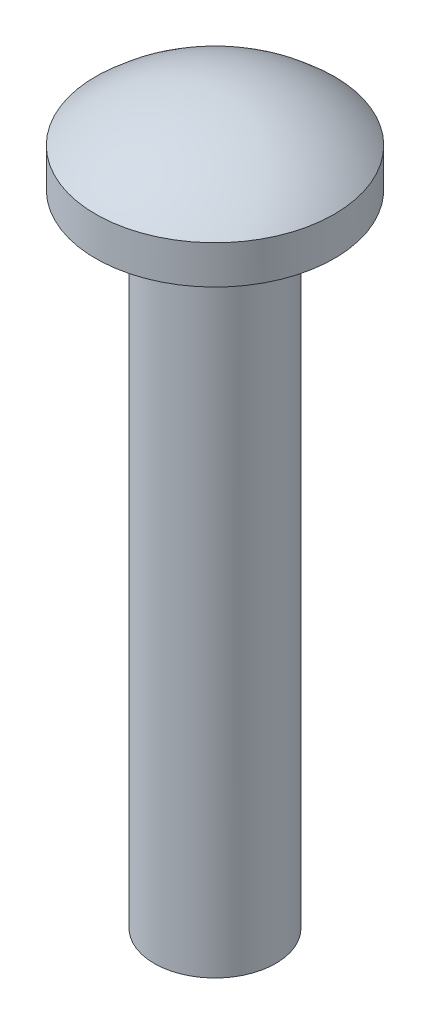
ISO-10303-21;
HEADER;
FILE_DESCRIPTION(('STEP AP214'),'2;1');
FILE_NAME('part.step','',(''),(''),'','','');
FILE_SCHEMA(('AUTOMOTIVE_DESIGN { 1 0 10303 214 1 1 1 1 }'));
ENDSEC;
DATA;
#1=APPLICATION_CONTEXT('core data for automotive mechanical design processes');
#2=APPLICATION_PROTOCOL_DEFINITION('international standard','automotive_design',2000,#1);
#3=PRODUCT_CONTEXT('',#1,'mechanical');
#4=PRODUCT('Part','Part','',(#3));
#5=PRODUCT_RELATED_PRODUCT_CATEGORY('part','',(#4));
#6=PRODUCT_DEFINITION_FORMATION('','',#4);
#7=PRODUCT_DEFINITION_CONTEXT('part definition',#1,'design');
#8=PRODUCT_DEFINITION('design','',#6,#7);
#9=PRODUCT_DEFINITION_SHAPE('','',#8);
#10=(LENGTH_UNIT() NAMED_UNIT(*) SI_UNIT(.MILLI.,.METRE.));
#11=(NAMED_UNIT(*) PLANE_ANGLE_UNIT() SI_UNIT($,.RADIAN.));
#12=(NAMED_UNIT(*) SI_UNIT($,.STERADIAN.) SOLID_ANGLE_UNIT());
#13=UNCERTAINTY_MEASURE_WITH_UNIT(LENGTH_MEASURE(1.E-05),#10,'distance_accuracy_value','');
#14=(GEOMETRIC_REPRESENTATION_CONTEXT(3) GLOBAL_UNCERTAINTY_ASSIGNED_CONTEXT((#13)) GLOBAL_UNIT_ASSIGNED_CONTEXT((#10,
#11,#12)) REPRESENTATION_CONTEXT('',''));
#15=CARTESIAN_POINT('',(0.,0.,0.));
#16=DIRECTION('',(0.,0.,1.));
#17=DIRECTION('',(1.,0.,0.));
#18=AXIS2_PLACEMENT_3D('',#15,#16,#17);
#19=CARTESIAN_POINT('',(0.,0.,0.));
#20=DIRECTION('',(0.,-1.,0.));
#21=DIRECTION('',(0.,0.,-1.));
#22=AXIS2_PLACEMENT_3D('',#19,#20,#21);
#23=PLANE('',#22);
#24=CARTESIAN_POINT('',(0.,0.,0.));
#25=DIRECTION('',(0.,-1.,0.));
#26=DIRECTION('',(0.,0.,-1.));
#27=AXIS2_PLACEMENT_3D('',#24,#25,#26);
#28=CIRCLE('',#27,2.413);
#29=CARTESIAN_POINT('',(0.,0.,-2.413));
#30=VERTEX_POINT('',#29);
#31=EDGE_CURVE('E10',#30,#30,#28,.T.);
#32=ORIENTED_EDGE('',*,*,#31,.F.);
#33=EDGE_LOOP('',(#32));
#34=FACE_BOUND('',#33,.T.);
#35=CARTESIAN_POINT('',(0.,0.,0.));
#36=DIRECTION('',(0.,-1.,0.));
#37=DIRECTION('',(0.,0.,-1.));
#38=AXIS2_PLACEMENT_3D('',#35,#36,#37);
#39=CIRCLE('',#38,4.7371);
#40=CARTESIAN_POINT('',(0.,0.,-4.7371));
#41=VERTEX_POINT('',#40);
#42=EDGE_CURVE('E41',#41,#41,#39,.T.);
#43=ORIENTED_EDGE('',*,*,#42,.T.);
#44=EDGE_LOOP('',(#43));
#45=FACE_BOUND('',#44,.T.);
#46=ADVANCED_FACE('F31',(#34,#45),#23,.T.);
#47=CARTESIAN_POINT('',(0.,-3.60005856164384,0.));
#48=DIRECTION('',(0.,-1.,0.));
#49=DIRECTION('',(1.,0.,0.));
#50=AXIS2_PLACEMENT_3D('',#47,#48,#49);
#51=SPHERICAL_SURFACE('',#50,6.97825856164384);
#52=CARTESIAN_POINT('',(0.,1.524,0.));
#53=DIRECTION('',(0.,-1.,0.));
#54=DIRECTION('',(0.,0.,-1.));
#55=AXIS2_PLACEMENT_3D('',#52,#53,#54);
#56=CIRCLE('',#55,4.7371);
#57=CARTESIAN_POINT('',(0.,1.524,-4.7371));
#58=VERTEX_POINT('',#57);
#59=EDGE_CURVE('E37',#58,#58,#56,.T.);
#60=ORIENTED_EDGE('',*,*,#59,.F.);
#61=EDGE_LOOP('',(#60));
#62=FACE_BOUND('',#61,.T.);
#63=ADVANCED_FACE('F62',(#62),#51,.T.);
#64=CARTESIAN_POINT('',(0.,0.,0.));
#65=DIRECTION('',(0.,-1.,0.));
#66=DIRECTION('',(0.,0.,-1.));
#67=AXIS2_PLACEMENT_3D('',#64,#65,#66);
#68=CYLINDRICAL_SURFACE('',#67,4.7371);
#69=ORIENTED_EDGE('',*,*,#59,.T.);
#70=EDGE_LOOP('',(#69));
#71=FACE_BOUND('',#70,.T.);
#72=ORIENTED_EDGE('',*,*,#42,.F.);
#73=EDGE_LOOP('',(#72));
#74=FACE_BOUND('',#73,.T.);
#75=ADVANCED_FACE('F59',(#71,#74),#68,.T.);
#76=CARTESIAN_POINT('',(0.,-25.4,0.));
#77=DIRECTION('',(0.,1.,0.));
#78=DIRECTION('',(0.,0.,1.));
#79=AXIS2_PLACEMENT_3D('',#76,#77,#78);
#80=CYLINDRICAL_SURFACE('',#79,2.413);
#81=CARTESIAN_POINT('',(0.,-25.4,0.));
#82=DIRECTION('',(0.,1.,0.));
#83=DIRECTION('',(0.,0.,1.));
#84=AXIS2_PLACEMENT_3D('',#81,#82,#83);
#85=CIRCLE('',#84,2.413);
#86=CARTESIAN_POINT('',(0.,-25.4,2.413));
#87=VERTEX_POINT('',#86);
#88=EDGE_CURVE('E45',#87,#87,#85,.T.);
#89=ORIENTED_EDGE('',*,*,#88,.T.);
#90=EDGE_LOOP('',(#89));
#91=FACE_BOUND('',#90,.T.);
#92=ORIENTED_EDGE('',*,*,#31,.T.);
#93=EDGE_LOOP('',(#92));
#94=FACE_BOUND('',#93,.T.);
#95=ADVANCED_FACE('F51',(#91,#94),#80,.T.);
#96=CARTESIAN_POINT('',(0.,-25.4,0.));
#97=DIRECTION('',(0.,1.,0.));
#98=DIRECTION('',(0.,0.,1.));
#99=AXIS2_PLACEMENT_3D('',#96,#97,#98);
#100=PLANE('',#99);
#101=ORIENTED_EDGE('',*,*,#88,.F.);
#102=EDGE_LOOP('',(#101));
#103=FACE_BOUND('',#102,.T.);
#104=ADVANCED_FACE('F53',(#103),#100,.F.);
#105=CLOSED_SHELL('',(#46,#63,#75,#95,#104));
#106=MANIFOLD_SOLID_BREP('B2',#105);
#107=ADVANCED_BREP_SHAPE_REPRESENTATION('',(#18,#106),#14);
#108=SHAPE_DEFINITION_REPRESENTATION(#9,#107);
ENDSEC;
END-ISO-10303-21;
